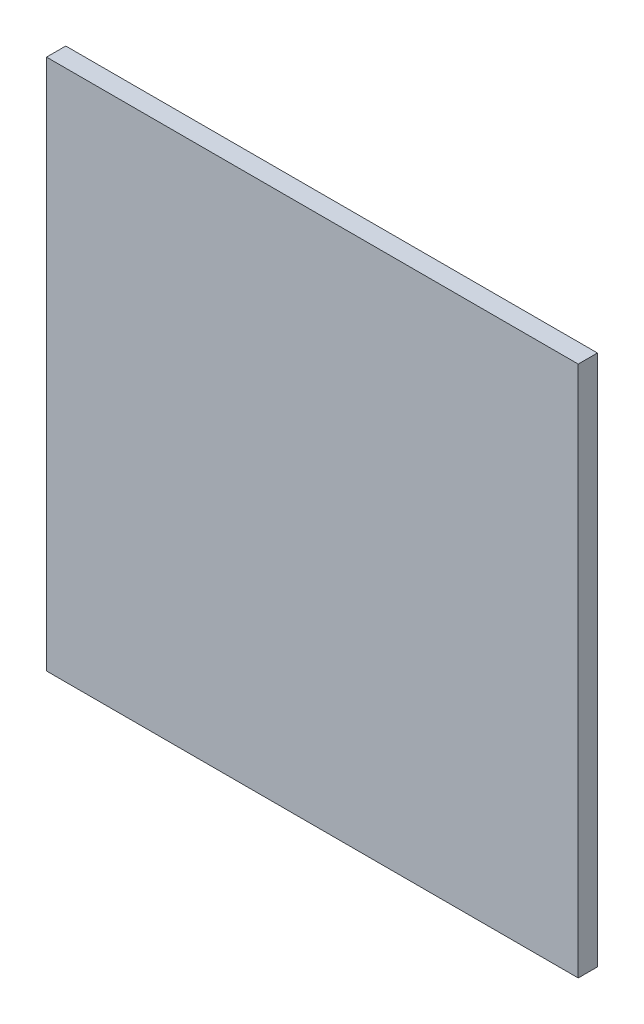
from build123d import *

# Parameters (mm, degrees)
CROQUIS1_W              = 415
CROQUIS1_H              = 415
SALIENTE_EXTRUIR1_DEPTH = 15


with BuildPart() as part:
    # Croquis1 → Saliente-Extruir1 (new body)
    with BuildSketch(Plane.XY):
        Rectangle(CROQUIS1_W, CROQUIS1_H)
    extrude(amount=SALIENTE_EXTRUIR1_DEPTH)


solid = part.part
